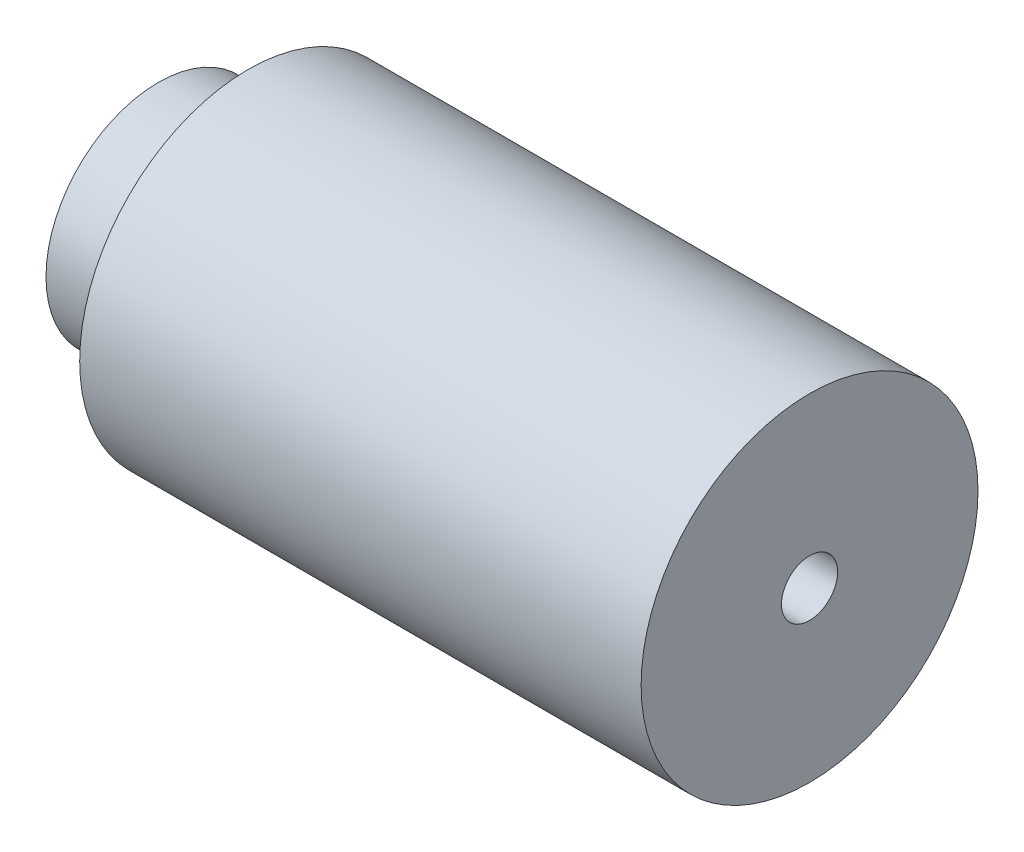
ISO-10303-21;
HEADER;
FILE_DESCRIPTION(('STEP AP214'),'2;1');
FILE_NAME('part.step','',(''),(''),'','','');
FILE_SCHEMA(('AUTOMOTIVE_DESIGN { 1 0 10303 214 1 1 1 1 }'));
ENDSEC;
DATA;
#1=APPLICATION_CONTEXT('core data for automotive mechanical design processes');
#2=APPLICATION_PROTOCOL_DEFINITION('international standard','automotive_design',2000,#1);
#3=PRODUCT_CONTEXT('',#1,'mechanical');
#4=PRODUCT('Part','Part','',(#3));
#5=PRODUCT_RELATED_PRODUCT_CATEGORY('part','',(#4));
#6=PRODUCT_DEFINITION_FORMATION('','',#4);
#7=PRODUCT_DEFINITION_CONTEXT('part definition',#1,'design');
#8=PRODUCT_DEFINITION('design','',#6,#7);
#9=PRODUCT_DEFINITION_SHAPE('','',#8);
#10=(LENGTH_UNIT() NAMED_UNIT(*) SI_UNIT(.MILLI.,.METRE.));
#11=(NAMED_UNIT(*) PLANE_ANGLE_UNIT() SI_UNIT($,.RADIAN.));
#12=(NAMED_UNIT(*) SI_UNIT($,.STERADIAN.) SOLID_ANGLE_UNIT());
#13=UNCERTAINTY_MEASURE_WITH_UNIT(LENGTH_MEASURE(1.E-05),#10,'distance_accuracy_value','');
#14=(GEOMETRIC_REPRESENTATION_CONTEXT(3) GLOBAL_UNCERTAINTY_ASSIGNED_CONTEXT((#13)) GLOBAL_UNIT_ASSIGNED_CONTEXT((#10,
#11,#12)) REPRESENTATION_CONTEXT('',''));
#15=CARTESIAN_POINT('',(0.,0.,0.));
#16=DIRECTION('',(0.,0.,1.));
#17=DIRECTION('',(1.,0.,0.));
#18=AXIS2_PLACEMENT_3D('',#15,#16,#17);
#19=CARTESIAN_POINT('',(50.,0.,0.));
#20=DIRECTION('',(-1.,0.,0.));
#21=DIRECTION('',(0.,0.,1.));
#22=AXIS2_PLACEMENT_3D('',#19,#20,#21);
#23=CYLINDRICAL_SURFACE('',#22,15.);
#24=CARTESIAN_POINT('',(50.,0.,0.));
#25=DIRECTION('',(1.,0.,0.));
#26=DIRECTION('',(0.,0.,-1.));
#27=AXIS2_PLACEMENT_3D('',#24,#25,#26);
#28=CIRCLE('',#27,15.);
#29=CARTESIAN_POINT('',(50.,0.,-15.));
#30=VERTEX_POINT('',#29);
#31=EDGE_CURVE('E45',#30,#30,#28,.T.);
#32=ORIENTED_EDGE('',*,*,#31,.F.);
#33=EDGE_LOOP('',(#32));
#34=FACE_BOUND('',#33,.T.);
#35=CARTESIAN_POINT('',(0.,0.,0.));
#36=DIRECTION('',(1.,0.,0.));
#37=DIRECTION('',(0.,0.,-1.));
#38=AXIS2_PLACEMENT_3D('',#35,#36,#37);
#39=CIRCLE('',#38,15.);
#40=CARTESIAN_POINT('',(0.,0.,-15.));
#41=VERTEX_POINT('',#40);
#42=EDGE_CURVE('E48',#41,#41,#39,.T.);
#43=ORIENTED_EDGE('',*,*,#42,.T.);
#44=EDGE_LOOP('',(#43));
#45=FACE_BOUND('',#44,.T.);
#46=ADVANCED_FACE('F30',(#34,#45),#23,.T.);
#47=CARTESIAN_POINT('',(50.,0.,0.));
#48=DIRECTION('',(1.,0.,0.));
#49=DIRECTION('',(0.,0.,-1.));
#50=AXIS2_PLACEMENT_3D('',#47,#48,#49);
#51=PLANE('',#50);
#52=CARTESIAN_POINT('',(50.,0.,0.));
#53=DIRECTION('',(1.,0.,0.));
#54=DIRECTION('',(0.,0.,-1.));
#55=AXIS2_PLACEMENT_3D('',#52,#53,#54);
#56=CIRCLE('',#55,2.5);
#57=CARTESIAN_POINT('',(50.,0.,-2.5));
#58=VERTEX_POINT('',#57);
#59=EDGE_CURVE('E59',#58,#58,#56,.T.);
#60=ORIENTED_EDGE('',*,*,#59,.F.);
#61=EDGE_LOOP('',(#60));
#62=FACE_BOUND('',#61,.T.);
#63=ORIENTED_EDGE('',*,*,#31,.T.);
#64=EDGE_LOOP('',(#63));
#65=FACE_BOUND('',#64,.T.);
#66=ADVANCED_FACE('F65',(#62,#65),#51,.T.);
#67=CARTESIAN_POINT('',(0.,0.,0.));
#68=DIRECTION('',(1.,0.,0.));
#69=DIRECTION('',(0.,0.,-1.));
#70=AXIS2_PLACEMENT_3D('',#67,#68,#69);
#71=PLANE('',#70);
#72=CARTESIAN_POINT('',(0.,0.,0.));
#73=DIRECTION('',(1.,0.,0.));
#74=DIRECTION('',(0.,0.,-1.));
#75=AXIS2_PLACEMENT_3D('',#72,#73,#74);
#76=CIRCLE('',#75,10.);
#77=CARTESIAN_POINT('',(0.,0.,-10.));
#78=VERTEX_POINT('',#77);
#79=EDGE_CURVE('E41',#78,#78,#76,.F.);
#80=ORIENTED_EDGE('',*,*,#79,.F.);
#81=EDGE_LOOP('',(#80));
#82=FACE_BOUND('',#81,.T.);
#83=ORIENTED_EDGE('',*,*,#42,.F.);
#84=EDGE_LOOP('',(#83));
#85=FACE_BOUND('',#84,.T.);
#86=ADVANCED_FACE('F68',(#82,#85),#71,.F.);
#87=CARTESIAN_POINT('',(-8.,0.,0.));
#88=DIRECTION('',(1.,0.,0.));
#89=DIRECTION('',(0.,0.,-1.));
#90=AXIS2_PLACEMENT_3D('',#87,#88,#89);
#91=CYLINDRICAL_SURFACE('',#90,10.);
#92=CARTESIAN_POINT('',(-8.,0.,0.));
#93=DIRECTION('',(-1.,0.,0.));
#94=DIRECTION('',(0.,0.,1.));
#95=AXIS2_PLACEMENT_3D('',#92,#93,#94);
#96=CIRCLE('',#95,10.);
#97=CARTESIAN_POINT('',(-8.,0.,10.));
#98=VERTEX_POINT('',#97);
#99=EDGE_CURVE('E51',#98,#98,#96,.T.);
#100=ORIENTED_EDGE('',*,*,#99,.F.);
#101=EDGE_LOOP('',(#100));
#102=FACE_BOUND('',#101,.T.);
#103=ORIENTED_EDGE('',*,*,#79,.T.);
#104=EDGE_LOOP('',(#103));
#105=FACE_BOUND('',#104,.T.);
#106=ADVANCED_FACE('F77',(#102,#105),#91,.T.);
#107=CARTESIAN_POINT('',(-8.,0.,0.));
#108=DIRECTION('',(-1.,0.,0.));
#109=DIRECTION('',(0.,0.,1.));
#110=AXIS2_PLACEMENT_3D('',#107,#108,#109);
#111=PLANE('',#110);
#112=CARTESIAN_POINT('',(-8.,0.,0.));
#113=DIRECTION('',(-1.,0.,0.));
#114=DIRECTION('',(0.,0.,1.));
#115=AXIS2_PLACEMENT_3D('',#112,#113,#114);
#116=CIRCLE('',#115,6.);
#117=CARTESIAN_POINT('',(-8.,0.,6.));
#118=VERTEX_POINT('',#117);
#119=EDGE_CURVE('E56',#118,#118,#116,.T.);
#120=ORIENTED_EDGE('',*,*,#119,.F.);
#121=EDGE_LOOP('',(#120));
#122=FACE_BOUND('',#121,.T.);
#123=ORIENTED_EDGE('',*,*,#99,.T.);
#124=EDGE_LOOP('',(#123));
#125=FACE_BOUND('',#124,.T.);
#126=ADVANCED_FACE('F83',(#122,#125),#111,.T.);
#127=CARTESIAN_POINT('',(27.,0.,0.));
#128=DIRECTION('',(-1.,0.,0.));
#129=DIRECTION('',(0.,0.,1.));
#130=AXIS2_PLACEMENT_3D('',#127,#128,#129);
#131=CYLINDRICAL_SURFACE('',#130,6.);
#132=CARTESIAN_POINT('',(28.5000000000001,0.,0.));
#133=DIRECTION('',(-1.,0.,0.));
#134=DIRECTION('',(0.,0.,1.));
#135=AXIS2_PLACEMENT_3D('',#132,#133,#134);
#136=CIRCLE('',#135,6.);
#137=CARTESIAN_POINT('',(28.5000000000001,0.,6.));
#138=VERTEX_POINT('',#137);
#139=EDGE_CURVE('E10',#138,#138,#136,.F.);
#140=ORIENTED_EDGE('',*,*,#139,.T.);
#141=EDGE_LOOP('',(#140));
#142=FACE_BOUND('',#141,.T.);
#143=ORIENTED_EDGE('',*,*,#119,.T.);
#144=EDGE_LOOP('',(#143));
#145=FACE_BOUND('',#144,.T.);
#146=ADVANCED_FACE('F90',(#142,#145),#131,.F.);
#147=CARTESIAN_POINT('',(62.,0.,0.));
#148=DIRECTION('',(-1.,0.,0.));
#149=DIRECTION('',(0.,0.,1.));
#150=AXIS2_PLACEMENT_3D('',#147,#148,#149);
#151=CYLINDRICAL_SURFACE('',#150,2.5);
#152=CARTESIAN_POINT('',(32.0000000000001,0.,0.));
#153=DIRECTION('',(-1.,0.,0.));
#154=DIRECTION('',(0.,0.,1.));
#155=AXIS2_PLACEMENT_3D('',#152,#153,#154);
#156=CIRCLE('',#155,2.5);
#157=CARTESIAN_POINT('',(32.0000000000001,0.,2.5));
#158=VERTEX_POINT('',#157);
#159=EDGE_CURVE('E37',#158,#158,#156,.T.);
#160=ORIENTED_EDGE('',*,*,#159,.T.);
#161=EDGE_LOOP('',(#160));
#162=FACE_BOUND('',#161,.T.);
#163=ORIENTED_EDGE('',*,*,#59,.T.);
#164=EDGE_LOOP('',(#163));
#165=FACE_BOUND('',#164,.T.);
#166=ADVANCED_FACE('F63',(#162,#165),#151,.F.);
#167=CARTESIAN_POINT('',(32.0000000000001,0.,0.));
#168=DIRECTION('',(-1.,0.,0.));
#169=DIRECTION('',(0.,0.,1.));
#170=AXIS2_PLACEMENT_3D('',#167,#168,#169);
#171=CONICAL_SURFACE('',#170,2.5,0.785398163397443);
#172=ORIENTED_EDGE('',*,*,#139,.F.);
#173=EDGE_LOOP('',(#172));
#174=FACE_BOUND('',#173,.T.);
#175=ORIENTED_EDGE('',*,*,#159,.F.);
#176=EDGE_LOOP('',(#175));
#177=FACE_BOUND('',#176,.T.);
#178=ADVANCED_FACE('F32',(#174,#177),#171,.F.);
#179=CLOSED_SHELL('',(#46,#66,#86,#106,#126,#146,#166,#178));
#180=MANIFOLD_SOLID_BREP('B2',#179);
#181=ADVANCED_BREP_SHAPE_REPRESENTATION('',(#18,#180),#14);
#182=SHAPE_DEFINITION_REPRESENTATION(#9,#181);
ENDSEC;
END-ISO-10303-21;
